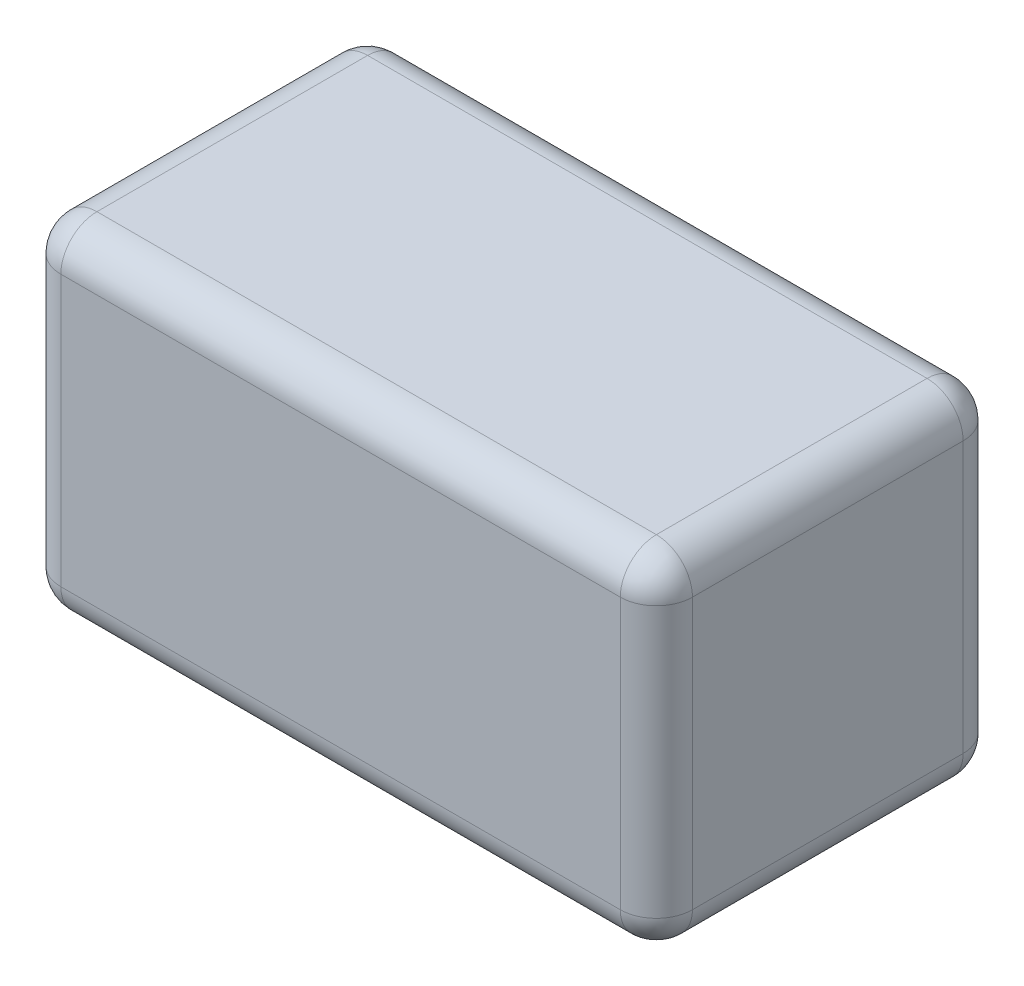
ISO-10303-21;
HEADER;
FILE_DESCRIPTION(('STEP AP214'),'2;1');
FILE_NAME('part.step','',(''),(''),'','','');
FILE_SCHEMA(('AUTOMOTIVE_DESIGN { 1 0 10303 214 1 1 1 1 }'));
ENDSEC;
DATA;
#1=APPLICATION_CONTEXT('core data for automotive mechanical design processes');
#2=APPLICATION_PROTOCOL_DEFINITION('international standard','automotive_design',2000,#1);
#3=PRODUCT_CONTEXT('',#1,'mechanical');
#4=PRODUCT('Part','Part','',(#3));
#5=PRODUCT_RELATED_PRODUCT_CATEGORY('part','',(#4));
#6=PRODUCT_DEFINITION_FORMATION('','',#4);
#7=PRODUCT_DEFINITION_CONTEXT('part definition',#1,'design');
#8=PRODUCT_DEFINITION('design','',#6,#7);
#9=PRODUCT_DEFINITION_SHAPE('','',#8);
#10=(LENGTH_UNIT() NAMED_UNIT(*) SI_UNIT(.MILLI.,.METRE.));
#11=(NAMED_UNIT(*) PLANE_ANGLE_UNIT() SI_UNIT($,.RADIAN.));
#12=(NAMED_UNIT(*) SI_UNIT($,.STERADIAN.) SOLID_ANGLE_UNIT());
#13=UNCERTAINTY_MEASURE_WITH_UNIT(LENGTH_MEASURE(1.E-05),#10,'distance_accuracy_value','');
#14=(GEOMETRIC_REPRESENTATION_CONTEXT(3) GLOBAL_UNCERTAINTY_ASSIGNED_CONTEXT((#13)) GLOBAL_UNIT_ASSIGNED_CONTEXT((#10,
#11,#12)) REPRESENTATION_CONTEXT('',''));
#15=CARTESIAN_POINT('',(0.,0.,0.));
#16=DIRECTION('',(0.,0.,1.));
#17=DIRECTION('',(1.,0.,0.));
#18=AXIS2_PLACEMENT_3D('',#15,#16,#17);
#19=CARTESIAN_POINT('',(0.775,0.375,0.85));
#20=DIRECTION('',(1.,0.,0.));
#21=DIRECTION('',(0.,1.,0.));
#22=AXIS2_PLACEMENT_3D('',#19,#20,#21);
#23=SPHERICAL_SURFACE('',#22,0.1);
#24=CARTESIAN_POINT('',(0.775,0.375,0.85));
#25=DIRECTION('',(1.,0.,0.));
#26=DIRECTION('',(0.,0.,-1.));
#27=AXIS2_PLACEMENT_3D('',#24,#25,#26);
#28=CIRCLE('',#27,0.1);
#29=CARTESIAN_POINT('',(0.775,0.375,0.95));
#30=VERTEX_POINT('',#29);
#31=CARTESIAN_POINT('',(0.775,0.475,0.85));
#32=VERTEX_POINT('',#31);
#33=EDGE_CURVE('E309',#30,#32,#28,.F.);
#34=ORIENTED_EDGE('',*,*,#33,.F.);
#35=CARTESIAN_POINT('',(0.775,0.375,0.85));
#36=DIRECTION('',(0.,-1.,0.));
#37=DIRECTION('',(0.,0.,-1.));
#38=AXIS2_PLACEMENT_3D('',#35,#36,#37);
#39=CIRCLE('',#38,0.1);
#40=CARTESIAN_POINT('',(0.875,0.375,0.85));
#41=VERTEX_POINT('',#40);
#42=EDGE_CURVE('E306',#41,#30,#39,.T.);
#43=ORIENTED_EDGE('',*,*,#42,.F.);
#44=CARTESIAN_POINT('',(0.775,0.375,0.85));
#45=DIRECTION('',(0.,0.,-1.));
#46=DIRECTION('',(-1.,0.,0.));
#47=AXIS2_PLACEMENT_3D('',#44,#45,#46);
#48=CIRCLE('',#47,0.1);
#49=EDGE_CURVE('E298',#32,#41,#48,.T.);
#50=ORIENTED_EDGE('',*,*,#49,.F.);
#51=EDGE_LOOP('',(#34,#43,#50));
#52=FACE_BOUND('',#51,.T.);
#53=ADVANCED_FACE('F16',(#52),#23,.T.);
#54=CARTESIAN_POINT('',(0.775,0.375,0.1));
#55=DIRECTION('',(0.,1.,0.));
#56=DIRECTION('',(1.,0.,0.));
#57=AXIS2_PLACEMENT_3D('',#54,#55,#56);
#58=SPHERICAL_SURFACE('',#57,0.1);
#59=CARTESIAN_POINT('',(0.775,0.375,0.1));
#60=DIRECTION('',(-1.,0.,0.));
#61=DIRECTION('',(0.,0.,1.));
#62=AXIS2_PLACEMENT_3D('',#59,#60,#61);
#63=CIRCLE('',#62,0.1);
#64=CARTESIAN_POINT('',(0.775,0.474999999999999,0.0999999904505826));
#65=VERTEX_POINT('',#64);
#66=CARTESIAN_POINT('',(0.775,0.375000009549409,0.));
#67=VERTEX_POINT('',#66);
#68=EDGE_CURVE('E288',#65,#67,#63,.T.);
#69=ORIENTED_EDGE('',*,*,#68,.F.);
#70=CARTESIAN_POINT('',(0.775,0.375,0.1));
#71=DIRECTION('',(0.,0.,-1.));
#72=DIRECTION('',(-1.,0.,0.));
#73=AXIS2_PLACEMENT_3D('',#70,#71,#72);
#74=CIRCLE('',#73,0.1);
#75=CARTESIAN_POINT('',(0.875,0.375,0.1));
#76=VERTEX_POINT('',#75);
#77=EDGE_CURVE('E295',#76,#65,#74,.F.);
#78=ORIENTED_EDGE('',*,*,#77,.F.);
#79=CARTESIAN_POINT('',(0.775,0.375,0.0999999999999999));
#80=DIRECTION('',(0.,-1.,0.));
#81=DIRECTION('',(0.,0.,-1.));
#82=AXIS2_PLACEMENT_3D('',#79,#80,#81);
#83=CIRCLE('',#82,0.1);
#84=EDGE_CURVE('E284',#67,#76,#83,.T.);
#85=ORIENTED_EDGE('',*,*,#84,.F.);
#86=EDGE_LOOP('',(#69,#78,#85));
#87=FACE_BOUND('',#86,.T.);
#88=ADVANCED_FACE('F333',(#87),#58,.T.);
#89=CARTESIAN_POINT('',(-0.775,0.375,0.0999999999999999));
#90=DIRECTION('',(-1.,0.,0.));
#91=DIRECTION('',(0.,1.,0.));
#92=AXIS2_PLACEMENT_3D('',#89,#90,#91);
#93=SPHERICAL_SURFACE('',#92,0.1);
#94=CARTESIAN_POINT('',(-0.775,0.375,0.0999999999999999));
#95=DIRECTION('',(0.,-1.,0.));
#96=DIRECTION('',(0.,0.,-1.));
#97=AXIS2_PLACEMENT_3D('',#94,#95,#96);
#98=CIRCLE('',#97,0.1);
#99=CARTESIAN_POINT('',(-0.875,0.375,0.0999999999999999));
#100=VERTEX_POINT('',#99);
#101=CARTESIAN_POINT('',(-0.775,0.375,0.));
#102=VERTEX_POINT('',#101);
#103=EDGE_CURVE('E260',#100,#102,#98,.T.);
#104=ORIENTED_EDGE('',*,*,#103,.F.);
#105=CARTESIAN_POINT('',(-0.775,0.375,0.0999999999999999));
#106=DIRECTION('',(0.,0.,1.));
#107=DIRECTION('',(1.,0.,0.));
#108=AXIS2_PLACEMENT_3D('',#105,#106,#107);
#109=CIRCLE('',#108,0.1);
#110=CARTESIAN_POINT('',(-0.775,0.475,0.0999999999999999));
#111=VERTEX_POINT('',#110);
#112=EDGE_CURVE('E265',#111,#100,#109,.T.);
#113=ORIENTED_EDGE('',*,*,#112,.F.);
#114=CARTESIAN_POINT('',(-0.775,0.375,0.0999999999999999));
#115=DIRECTION('',(-1.,0.,0.));
#116=DIRECTION('',(0.,0.,1.));
#117=AXIS2_PLACEMENT_3D('',#114,#115,#116);
#118=CIRCLE('',#117,0.1);
#119=EDGE_CURVE('E279',#102,#111,#118,.F.);
#120=ORIENTED_EDGE('',*,*,#119,.F.);
#121=EDGE_LOOP('',(#104,#113,#120));
#122=FACE_BOUND('',#121,.T.);
#123=ADVANCED_FACE('F329',(#122),#93,.T.);
#124=CARTESIAN_POINT('',(-0.775,0.375,0.85));
#125=DIRECTION('',(0.,1.,0.));
#126=DIRECTION('',(-1.,0.,0.));
#127=AXIS2_PLACEMENT_3D('',#124,#125,#126);
#128=SPHERICAL_SURFACE('',#127,0.1);
#129=CARTESIAN_POINT('',(-0.775,0.375,0.85));
#130=DIRECTION('',(0.,-1.,0.));
#131=DIRECTION('',(0.,0.,-1.));
#132=AXIS2_PLACEMENT_3D('',#129,#130,#131);
#133=CIRCLE('',#132,0.1);
#134=CARTESIAN_POINT('',(-0.775,0.375000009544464,0.95));
#135=VERTEX_POINT('',#134);
#136=CARTESIAN_POINT('',(-0.875,0.375,0.85));
#137=VERTEX_POINT('',#136);
#138=EDGE_CURVE('E253',#135,#137,#133,.T.);
#139=ORIENTED_EDGE('',*,*,#138,.F.);
#140=CARTESIAN_POINT('',(-0.775,0.375,0.85));
#141=DIRECTION('',(1.,0.,0.));
#142=DIRECTION('',(0.,0.,-1.));
#143=AXIS2_PLACEMENT_3D('',#140,#141,#142);
#144=CIRCLE('',#143,0.1);
#145=CARTESIAN_POINT('',(-0.775,0.474999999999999,0.850000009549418));
#146=VERTEX_POINT('',#145);
#147=EDGE_CURVE('E255',#146,#135,#144,.T.);
#148=ORIENTED_EDGE('',*,*,#147,.F.);
#149=CARTESIAN_POINT('',(-0.775,0.375,0.85));
#150=DIRECTION('',(0.,0.,1.));
#151=DIRECTION('',(1.,0.,0.));
#152=AXIS2_PLACEMENT_3D('',#149,#150,#151);
#153=CIRCLE('',#152,0.1);
#154=EDGE_CURVE('E276',#137,#146,#153,.F.);
#155=ORIENTED_EDGE('',*,*,#154,.F.);
#156=EDGE_LOOP('',(#139,#148,#155));
#157=FACE_BOUND('',#156,.T.);
#158=ADVANCED_FACE('F324',(#157),#128,.T.);
#159=CARTESIAN_POINT('',(0.775,-0.775,0.85));
#160=DIRECTION('',(0.,-1.,0.));
#161=DIRECTION('',(0.,0.,-1.));
#162=AXIS2_PLACEMENT_3D('',#159,#160,#161);
#163=CYLINDRICAL_SURFACE('',#162,0.1);
#164=DIRECTION('',(0.,1.,0.));
#165=VECTOR('',#164,1.);
#166=CARTESIAN_POINT('',(0.875,-0.475,0.85));
#167=LINE('',#166,#165);
#168=CARTESIAN_POINT('',(0.875,-0.375,0.85));
#169=VERTEX_POINT('',#168);
#170=EDGE_CURVE('E241',#41,#169,#167,.F.);
#171=ORIENTED_EDGE('',*,*,#170,.F.);
#172=ORIENTED_EDGE('',*,*,#42,.T.);
#173=DIRECTION('',(0.,1.,0.));
#174=VECTOR('',#173,1.);
#175=CARTESIAN_POINT('',(0.775,-0.475,0.95));
#176=LINE('',#175,#174);
#177=CARTESIAN_POINT('',(0.775,-0.375000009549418,0.95));
#178=VERTEX_POINT('',#177);
#179=EDGE_CURVE('E242',#178,#30,#176,.T.);
#180=ORIENTED_EDGE('',*,*,#179,.F.);
#181=CARTESIAN_POINT('',(0.775,-0.375,0.85));
#182=DIRECTION('',(0.,-1.,0.));
#183=DIRECTION('',(1.,0.,0.));
#184=AXIS2_PLACEMENT_3D('',#181,#182,#183);
#185=CIRCLE('',#184,0.1);
#186=EDGE_CURVE('E238',#169,#178,#185,.T.);
#187=ORIENTED_EDGE('',*,*,#186,.F.);
#188=EDGE_LOOP('',(#171,#172,#180,#187));
#189=FACE_BOUND('',#188,.T.);
#190=ADVANCED_FACE('F328',(#189),#163,.T.);
#191=CARTESIAN_POINT('',(0.775,0.375,1.35));
#192=DIRECTION('',(0.,0.,-1.));
#193=DIRECTION('',(-1.,0.,0.));
#194=AXIS2_PLACEMENT_3D('',#191,#192,#193);
#195=CYLINDRICAL_SURFACE('',#194,0.1);
#196=ORIENTED_EDGE('',*,*,#77,.T.);
#197=DIRECTION('',(0.,0.,-1.));
#198=VECTOR('',#197,1.);
#199=CARTESIAN_POINT('',(0.775,0.475,1.35));
#200=LINE('',#199,#198);
#201=EDGE_CURVE('E292',#65,#32,#200,.F.);
#202=ORIENTED_EDGE('',*,*,#201,.T.);
#203=ORIENTED_EDGE('',*,*,#49,.T.);
#204=DIRECTION('',(0.,0.,-1.));
#205=VECTOR('',#204,1.);
#206=CARTESIAN_POINT('',(0.875,0.375,0.95));
#207=LINE('',#206,#205);
#208=EDGE_CURVE('E301',#76,#41,#207,.F.);
#209=ORIENTED_EDGE('',*,*,#208,.F.);
#210=EDGE_LOOP('',(#196,#202,#203,#209));
#211=FACE_BOUND('',#210,.T.);
#212=ADVANCED_FACE('F433',(#211),#195,.T.);
#213=CARTESIAN_POINT('',(0.,0.475,0.));
#214=DIRECTION('',(0.,1.,0.));
#215=DIRECTION('',(0.,0.,1.));
#216=AXIS2_PLACEMENT_3D('',#213,#214,#215);
#217=PLANE('',#216);
#218=DIRECTION('',(0.,0.,1.));
#219=VECTOR('',#218,1.);
#220=CARTESIAN_POINT('',(-0.775,0.475,-0.4));
#221=LINE('',#220,#219);
#222=EDGE_CURVE('E273',#146,#111,#221,.F.);
#223=ORIENTED_EDGE('',*,*,#222,.F.);
#224=DIRECTION('',(1.,0.,0.));
#225=VECTOR('',#224,1.);
#226=CARTESIAN_POINT('',(-1.175,0.474999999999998,0.850000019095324));
#227=LINE('',#226,#225);
#228=EDGE_CURVE('E250',#32,#146,#227,.F.);
#229=ORIENTED_EDGE('',*,*,#228,.F.);
#230=ORIENTED_EDGE('',*,*,#201,.F.);
#231=DIRECTION('',(-1.,0.,0.));
#232=VECTOR('',#231,1.);
#233=CARTESIAN_POINT('',(1.175,0.475,0.100000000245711));
#234=LINE('',#233,#232);
#235=EDGE_CURVE('E124',#111,#65,#234,.F.);
#236=ORIENTED_EDGE('',*,*,#235,.F.);
#237=EDGE_LOOP('',(#223,#229,#230,#236));
#238=FACE_BOUND('',#237,.T.);
#239=ADVANCED_FACE('F375',(#238),#217,.T.);
#240=CARTESIAN_POINT('',(0.775,-0.775,0.1));
#241=DIRECTION('',(0.,-1.,0.));
#242=DIRECTION('',(0.,0.,-1.));
#243=AXIS2_PLACEMENT_3D('',#240,#241,#242);
#244=CYLINDRICAL_SURFACE('',#243,0.1);
#245=DIRECTION('',(0.,1.,0.));
#246=VECTOR('',#245,1.);
#247=CARTESIAN_POINT('',(0.775,-0.475,0.));
#248=LINE('',#247,#246);
#249=CARTESIAN_POINT('',(0.775,-0.375,0.));
#250=VERTEX_POINT('',#249);
#251=EDGE_CURVE('E117',#67,#250,#248,.F.);
#252=ORIENTED_EDGE('',*,*,#251,.F.);
#253=ORIENTED_EDGE('',*,*,#84,.T.);
#254=DIRECTION('',(0.,1.,0.));
#255=VECTOR('',#254,1.);
#256=CARTESIAN_POINT('',(0.875,-0.475,0.1));
#257=LINE('',#256,#255);
#258=CARTESIAN_POINT('',(0.875,-0.375,0.1));
#259=VERTEX_POINT('',#258);
#260=EDGE_CURVE('E129',#259,#76,#257,.T.);
#261=ORIENTED_EDGE('',*,*,#260,.F.);
#262=CARTESIAN_POINT('',(0.775,-0.375,0.1));
#263=DIRECTION('',(0.,1.,0.));
#264=DIRECTION('',(1.,0.,0.));
#265=AXIS2_PLACEMENT_3D('',#262,#263,#264);
#266=CIRCLE('',#265,0.1);
#267=EDGE_CURVE('E123',#250,#259,#266,.F.);
#268=ORIENTED_EDGE('',*,*,#267,.F.);
#269=EDGE_LOOP('',(#252,#253,#261,#268));
#270=FACE_BOUND('',#269,.T.);
#271=ADVANCED_FACE('F127',(#270),#244,.T.);
#272=CARTESIAN_POINT('',(-0.775,0.375,-0.4));
#273=DIRECTION('',(0.,0.,1.));
#274=DIRECTION('',(1.,0.,0.));
#275=AXIS2_PLACEMENT_3D('',#272,#273,#274);
#276=CYLINDRICAL_SURFACE('',#275,0.1);
#277=ORIENTED_EDGE('',*,*,#112,.T.);
#278=DIRECTION('',(0.,0.,1.));
#279=VECTOR('',#278,1.);
#280=CARTESIAN_POINT('',(-0.875,0.375,0.));
#281=LINE('',#280,#279);
#282=EDGE_CURVE('E203',#137,#100,#281,.F.);
#283=ORIENTED_EDGE('',*,*,#282,.F.);
#284=ORIENTED_EDGE('',*,*,#154,.T.);
#285=ORIENTED_EDGE('',*,*,#222,.T.);
#286=EDGE_LOOP('',(#277,#283,#284,#285));
#287=FACE_BOUND('',#286,.T.);
#288=ADVANCED_FACE('F373',(#287),#276,.T.);
#289=CARTESIAN_POINT('',(-0.775,-0.775,0.0999999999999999));
#290=DIRECTION('',(0.,-1.,0.));
#291=DIRECTION('',(0.,0.,-1.));
#292=AXIS2_PLACEMENT_3D('',#289,#290,#291);
#293=CYLINDRICAL_SURFACE('',#292,0.1);
#294=DIRECTION('',(0.,1.,0.));
#295=VECTOR('',#294,1.);
#296=CARTESIAN_POINT('',(-0.875,-0.475,0.0999999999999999));
#297=LINE('',#296,#295);
#298=CARTESIAN_POINT('',(-0.875,-0.375,0.0999999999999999));
#299=VERTEX_POINT('',#298);
#300=EDGE_CURVE('E193',#100,#299,#297,.F.);
#301=ORIENTED_EDGE('',*,*,#300,.F.);
#302=ORIENTED_EDGE('',*,*,#103,.T.);
#303=DIRECTION('',(0.,1.,0.));
#304=VECTOR('',#303,1.);
#305=CARTESIAN_POINT('',(-0.775,-0.475,0.));
#306=LINE('',#305,#304);
#307=CARTESIAN_POINT('',(-0.775,-0.375000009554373,0.));
#308=VERTEX_POINT('',#307);
#309=EDGE_CURVE('E133',#308,#102,#306,.T.);
#310=ORIENTED_EDGE('',*,*,#309,.F.);
#311=CARTESIAN_POINT('',(-0.775,-0.375,0.0999999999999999));
#312=DIRECTION('',(0.,-1.,0.));
#313=DIRECTION('',(-1.,0.,0.));
#314=AXIS2_PLACEMENT_3D('',#311,#312,#313);
#315=CIRCLE('',#314,0.1);
#316=EDGE_CURVE('E190',#299,#308,#315,.T.);
#317=ORIENTED_EDGE('',*,*,#316,.F.);
#318=EDGE_LOOP('',(#301,#302,#310,#317));
#319=FACE_BOUND('',#318,.T.);
#320=ADVANCED_FACE('F501',(#319),#293,.T.);
#321=CARTESIAN_POINT('',(-0.775,-0.775,0.85));
#322=DIRECTION('',(0.,-1.,0.));
#323=DIRECTION('',(0.,0.,-1.));
#324=AXIS2_PLACEMENT_3D('',#321,#322,#323);
#325=CYLINDRICAL_SURFACE('',#324,0.1);
#326=DIRECTION('',(0.,1.,0.));
#327=VECTOR('',#326,1.);
#328=CARTESIAN_POINT('',(-0.775,-0.475,0.95));
#329=LINE('',#328,#327);
#330=CARTESIAN_POINT('',(-0.775,-0.375,0.95));
#331=VERTEX_POINT('',#330);
#332=EDGE_CURVE('E192',#135,#331,#329,.F.);
#333=ORIENTED_EDGE('',*,*,#332,.F.);
#334=ORIENTED_EDGE('',*,*,#138,.T.);
#335=DIRECTION('',(0.,1.,0.));
#336=VECTOR('',#335,1.);
#337=CARTESIAN_POINT('',(-0.875,-0.475,0.85));
#338=LINE('',#337,#336);
#339=CARTESIAN_POINT('',(-0.875,-0.375,0.85));
#340=VERTEX_POINT('',#339);
#341=EDGE_CURVE('E206',#340,#137,#338,.T.);
#342=ORIENTED_EDGE('',*,*,#341,.F.);
#343=CARTESIAN_POINT('',(-0.775,-0.375,0.85));
#344=DIRECTION('',(0.,1.,0.));
#345=DIRECTION('',(-1.,0.,0.));
#346=AXIS2_PLACEMENT_3D('',#343,#344,#345);
#347=CIRCLE('',#346,0.1);
#348=EDGE_CURVE('E168',#331,#340,#347,.F.);
#349=ORIENTED_EDGE('',*,*,#348,.F.);
#350=EDGE_LOOP('',(#333,#334,#342,#349));
#351=FACE_BOUND('',#350,.T.);
#352=ADVANCED_FACE('F385',(#351),#325,.T.);
#353=CARTESIAN_POINT('',(-1.175,0.375,0.85));
#354=DIRECTION('',(1.,0.,0.));
#355=DIRECTION('',(0.,0.,-1.));
#356=AXIS2_PLACEMENT_3D('',#353,#354,#355);
#357=CYLINDRICAL_SURFACE('',#356,0.1);
#358=DIRECTION('',(1.,0.,0.));
#359=VECTOR('',#358,1.);
#360=CARTESIAN_POINT('',(-0.875,0.375000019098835,0.95));
#361=LINE('',#360,#359);
#362=EDGE_CURVE('E163',#30,#135,#361,.F.);
#363=ORIENTED_EDGE('',*,*,#362,.F.);
#364=ORIENTED_EDGE('',*,*,#33,.T.);
#365=ORIENTED_EDGE('',*,*,#228,.T.);
#366=ORIENTED_EDGE('',*,*,#147,.T.);
#367=EDGE_LOOP('',(#363,#364,#365,#366));
#368=FACE_BOUND('',#367,.T.);
#369=ADVANCED_FACE('F230',(#368),#357,.T.);
#370=CARTESIAN_POINT('',(0.775,-0.375,0.85));
#371=DIRECTION('',(0.,-1.,0.));
#372=DIRECTION('',(1.,0.,0.));
#373=AXIS2_PLACEMENT_3D('',#370,#371,#372);
#374=SPHERICAL_SURFACE('',#373,0.1);
#375=CARTESIAN_POINT('',(0.775,-0.375,0.85));
#376=DIRECTION('',(-1.,0.,0.));
#377=DIRECTION('',(0.,0.,1.));
#378=AXIS2_PLACEMENT_3D('',#375,#376,#377);
#379=CIRCLE('',#378,0.1);
#380=CARTESIAN_POINT('',(0.775,-0.475,0.850000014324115));
#381=VERTEX_POINT('',#380);
#382=EDGE_CURVE('E158',#381,#178,#379,.T.);
#383=ORIENTED_EDGE('',*,*,#382,.F.);
#384=CARTESIAN_POINT('',(0.775,-0.375,0.85));
#385=DIRECTION('',(0.,0.,1.));
#386=DIRECTION('',(1.,0.,0.));
#387=AXIS2_PLACEMENT_3D('',#384,#385,#386);
#388=CIRCLE('',#387,0.1);
#389=EDGE_CURVE('E153',#169,#381,#388,.F.);
#390=ORIENTED_EDGE('',*,*,#389,.F.);
#391=ORIENTED_EDGE('',*,*,#186,.T.);
#392=EDGE_LOOP('',(#383,#390,#391));
#393=FACE_BOUND('',#392,.T.);
#394=ADVANCED_FACE('F225',(#393),#374,.T.);
#395=CARTESIAN_POINT('',(0.875,-0.475,0.95));
#396=DIRECTION('',(1.,0.,0.));
#397=DIRECTION('',(0.,0.,-1.));
#398=AXIS2_PLACEMENT_3D('',#395,#396,#397);
#399=PLANE('',#398);
#400=ORIENTED_EDGE('',*,*,#260,.T.);
#401=ORIENTED_EDGE('',*,*,#208,.T.);
#402=ORIENTED_EDGE('',*,*,#170,.T.);
#403=DIRECTION('',(0.,0.,1.));
#404=VECTOR('',#403,1.);
#405=CARTESIAN_POINT('',(0.875,-0.375,1.35));
#406=LINE('',#405,#404);
#407=EDGE_CURVE('E141',#259,#169,#406,.T.);
#408=ORIENTED_EDGE('',*,*,#407,.F.);
#409=EDGE_LOOP('',(#400,#401,#402,#408));
#410=FACE_BOUND('',#409,.T.);
#411=ADVANCED_FACE('F221',(#410),#399,.T.);
#412=CARTESIAN_POINT('',(1.175,0.375,0.1));
#413=DIRECTION('',(-1.,0.,0.));
#414=DIRECTION('',(0.,0.,1.));
#415=AXIS2_PLACEMENT_3D('',#412,#413,#414);
#416=CYLINDRICAL_SURFACE('',#415,0.1);
#417=DIRECTION('',(-1.,0.,0.));
#418=VECTOR('',#417,1.);
#419=CARTESIAN_POINT('',(0.875,0.374999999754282,0.));
#420=LINE('',#419,#418);
#421=EDGE_CURVE('E120',#102,#67,#420,.F.);
#422=ORIENTED_EDGE('',*,*,#421,.F.);
#423=ORIENTED_EDGE('',*,*,#119,.T.);
#424=ORIENTED_EDGE('',*,*,#235,.T.);
#425=ORIENTED_EDGE('',*,*,#68,.T.);
#426=EDGE_LOOP('',(#422,#423,#424,#425));
#427=FACE_BOUND('',#426,.T.);
#428=ADVANCED_FACE('F218',(#427),#416,.T.);
#429=CARTESIAN_POINT('',(0.775,-0.375,0.1));
#430=DIRECTION('',(1.,0.,0.));
#431=DIRECTION('',(0.,-1.,0.));
#432=AXIS2_PLACEMENT_3D('',#429,#430,#431);
#433=SPHERICAL_SURFACE('',#432,0.1);
#434=CARTESIAN_POINT('',(0.775,-0.375,0.1));
#435=DIRECTION('',(1.,0.,0.));
#436=DIRECTION('',(0.,0.,-1.));
#437=AXIS2_PLACEMENT_3D('',#434,#435,#436);
#438=CIRCLE('',#437,0.1);
#439=CARTESIAN_POINT('',(0.775,-0.475,0.1));
#440=VERTEX_POINT('',#439);
#441=EDGE_CURVE('E105',#250,#440,#438,.F.);
#442=ORIENTED_EDGE('',*,*,#441,.F.);
#443=ORIENTED_EDGE('',*,*,#267,.T.);
#444=CARTESIAN_POINT('',(0.775,-0.375,0.1));
#445=DIRECTION('',(0.,0.,1.));
#446=DIRECTION('',(1.,0.,0.));
#447=AXIS2_PLACEMENT_3D('',#444,#445,#446);
#448=CIRCLE('',#447,0.1);
#449=EDGE_CURVE('E136',#440,#259,#448,.T.);
#450=ORIENTED_EDGE('',*,*,#449,.F.);
#451=EDGE_LOOP('',(#442,#443,#450));
#452=FACE_BOUND('',#451,.T.);
#453=ADVANCED_FACE('F135',(#452),#433,.T.);
#454=CARTESIAN_POINT('',(-0.875,-0.475,0.));
#455=DIRECTION('',(-1.,0.,0.));
#456=DIRECTION('',(0.,0.,1.));
#457=AXIS2_PLACEMENT_3D('',#454,#455,#456);
#458=PLANE('',#457);
#459=ORIENTED_EDGE('',*,*,#300,.T.);
#460=DIRECTION('',(0.,0.,-1.));
#461=VECTOR('',#460,1.);
#462=CARTESIAN_POINT('',(-0.875,-0.375,-0.4));
#463=LINE('',#462,#461);
#464=EDGE_CURVE('E196',#340,#299,#463,.T.);
#465=ORIENTED_EDGE('',*,*,#464,.F.);
#466=ORIENTED_EDGE('',*,*,#341,.T.);
#467=ORIENTED_EDGE('',*,*,#282,.T.);
#468=EDGE_LOOP('',(#459,#465,#466,#467));
#469=FACE_BOUND('',#468,.T.);
#470=ADVANCED_FACE('F182',(#469),#458,.T.);
#471=CARTESIAN_POINT('',(-0.775,-0.375,0.0999999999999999));
#472=DIRECTION('',(0.,-1.,0.));
#473=DIRECTION('',(-1.,0.,0.));
#474=AXIS2_PLACEMENT_3D('',#471,#472,#473);
#475=SPHERICAL_SURFACE('',#474,0.1);
#476=CARTESIAN_POINT('',(-0.775,-0.375,0.0999999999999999));
#477=DIRECTION('',(0.,0.,-1.));
#478=DIRECTION('',(-1.,0.,0.));
#479=AXIS2_PLACEMENT_3D('',#476,#477,#478);
#480=CIRCLE('',#479,0.1);
#481=CARTESIAN_POINT('',(-0.775,-0.475,0.0999999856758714));
#482=VERTEX_POINT('',#481);
#483=EDGE_CURVE('E199',#299,#482,#480,.F.);
#484=ORIENTED_EDGE('',*,*,#483,.F.);
#485=ORIENTED_EDGE('',*,*,#316,.T.);
#486=CARTESIAN_POINT('',(-0.775,-0.375,0.0999999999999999));
#487=DIRECTION('',(1.,0.,0.));
#488=DIRECTION('',(0.,0.,-1.));
#489=AXIS2_PLACEMENT_3D('',#486,#487,#488);
#490=CIRCLE('',#489,0.1);
#491=EDGE_CURVE('E108',#482,#308,#490,.T.);
#492=ORIENTED_EDGE('',*,*,#491,.F.);
#493=EDGE_LOOP('',(#484,#485,#492));
#494=FACE_BOUND('',#493,.T.);
#495=ADVANCED_FACE('F176',(#494),#475,.T.);
#496=CARTESIAN_POINT('',(-0.775,-0.375,0.85));
#497=DIRECTION('',(-1.,0.,0.));
#498=DIRECTION('',(0.,-1.,0.));
#499=AXIS2_PLACEMENT_3D('',#496,#497,#498);
#500=SPHERICAL_SURFACE('',#499,0.1);
#501=CARTESIAN_POINT('',(-0.775,-0.375,0.85));
#502=DIRECTION('',(0.,0.,-1.));
#503=DIRECTION('',(-1.,0.,0.));
#504=AXIS2_PLACEMENT_3D('',#501,#502,#503);
#505=CIRCLE('',#504,0.1);
#506=CARTESIAN_POINT('',(-0.775,-0.475,0.85));
#507=VERTEX_POINT('',#506);
#508=EDGE_CURVE('E139',#507,#340,#505,.T.);
#509=ORIENTED_EDGE('',*,*,#508,.F.);
#510=CARTESIAN_POINT('',(-0.775,-0.375,0.85));
#511=DIRECTION('',(-1.,0.,0.));
#512=DIRECTION('',(0.,0.,1.));
#513=AXIS2_PLACEMENT_3D('',#510,#511,#512);
#514=CIRCLE('',#513,0.1);
#515=EDGE_CURVE('E347',#331,#507,#514,.F.);
#516=ORIENTED_EDGE('',*,*,#515,.F.);
#517=ORIENTED_EDGE('',*,*,#348,.T.);
#518=EDGE_LOOP('',(#509,#516,#517));
#519=FACE_BOUND('',#518,.T.);
#520=ADVANCED_FACE('F171',(#519),#500,.T.);
#521=CARTESIAN_POINT('',(-0.875,-0.475,0.95));
#522=DIRECTION('',(0.,0.,1.));
#523=DIRECTION('',(1.,0.,0.));
#524=AXIS2_PLACEMENT_3D('',#521,#522,#523);
#525=PLANE('',#524);
#526=ORIENTED_EDGE('',*,*,#362,.T.);
#527=ORIENTED_EDGE('',*,*,#332,.T.);
#528=DIRECTION('',(1.,0.,0.));
#529=VECTOR('',#528,1.);
#530=CARTESIAN_POINT('',(-0.875,-0.375000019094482,0.95));
#531=LINE('',#530,#529);
#532=EDGE_CURVE('E149',#178,#331,#531,.F.);
#533=ORIENTED_EDGE('',*,*,#532,.F.);
#534=ORIENTED_EDGE('',*,*,#179,.T.);
#535=EDGE_LOOP('',(#526,#527,#533,#534));
#536=FACE_BOUND('',#535,.T.);
#537=ADVANCED_FACE('F175',(#536),#525,.T.);
#538=CARTESIAN_POINT('',(0.775,-0.375,1.35));
#539=DIRECTION('',(0.,0.,1.));
#540=DIRECTION('',(1.,0.,0.));
#541=AXIS2_PLACEMENT_3D('',#538,#539,#540);
#542=CYLINDRICAL_SURFACE('',#541,0.1);
#543=ORIENTED_EDGE('',*,*,#449,.T.);
#544=ORIENTED_EDGE('',*,*,#407,.T.);
#545=ORIENTED_EDGE('',*,*,#389,.T.);
#546=DIRECTION('',(0.,0.,1.));
#547=VECTOR('',#546,1.);
#548=CARTESIAN_POINT('',(0.775,-0.475,0.));
#549=LINE('',#548,#547);
#550=EDGE_CURVE('E114',#381,#440,#549,.F.);
#551=ORIENTED_EDGE('',*,*,#550,.T.);
#552=EDGE_LOOP('',(#543,#544,#545,#551));
#553=FACE_BOUND('',#552,.T.);
#554=ADVANCED_FACE('F421',(#553),#542,.T.);
#555=CARTESIAN_POINT('',(0.875,-0.475,0.));
#556=DIRECTION('',(0.,0.,-1.));
#557=DIRECTION('',(-1.,0.,0.));
#558=AXIS2_PLACEMENT_3D('',#555,#556,#557);
#559=PLANE('',#558);
#560=ORIENTED_EDGE('',*,*,#251,.T.);
#561=DIRECTION('',(-1.,0.,0.));
#562=VECTOR('',#561,1.);
#563=CARTESIAN_POINT('',(0.875,-0.375000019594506,0.));
#564=LINE('',#563,#562);
#565=EDGE_CURVE('E101',#308,#250,#564,.F.);
#566=ORIENTED_EDGE('',*,*,#565,.F.);
#567=ORIENTED_EDGE('',*,*,#309,.T.);
#568=ORIENTED_EDGE('',*,*,#421,.T.);
#569=EDGE_LOOP('',(#560,#566,#567,#568));
#570=FACE_BOUND('',#569,.T.);
#571=ADVANCED_FACE('F119',(#570),#559,.T.);
#572=CARTESIAN_POINT('',(-0.775,-0.375,-0.4));
#573=DIRECTION('',(0.,0.,-1.));
#574=DIRECTION('',(-1.,0.,0.));
#575=AXIS2_PLACEMENT_3D('',#572,#573,#574);
#576=CYLINDRICAL_SURFACE('',#575,0.1);
#577=ORIENTED_EDGE('',*,*,#483,.T.);
#578=DIRECTION('',(0.,0.,1.));
#579=VECTOR('',#578,1.);
#580=CARTESIAN_POINT('',(-0.775,-0.475,0.));
#581=LINE('',#580,#579);
#582=EDGE_CURVE('E113',#482,#507,#581,.T.);
#583=ORIENTED_EDGE('',*,*,#582,.T.);
#584=ORIENTED_EDGE('',*,*,#508,.T.);
#585=ORIENTED_EDGE('',*,*,#464,.T.);
#586=EDGE_LOOP('',(#577,#583,#584,#585));
#587=FACE_BOUND('',#586,.T.);
#588=ADVANCED_FACE('F396',(#587),#576,.T.);
#589=CARTESIAN_POINT('',(-1.175,-0.375,0.85));
#590=DIRECTION('',(-1.,0.,0.));
#591=DIRECTION('',(0.,0.,1.));
#592=AXIS2_PLACEMENT_3D('',#589,#590,#591);
#593=CYLINDRICAL_SURFACE('',#592,0.1);
#594=DIRECTION('',(1.,0.,0.));
#595=VECTOR('',#594,1.);
#596=CARTESIAN_POINT('',(0.,-0.475,0.850000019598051));
#597=LINE('',#596,#595);
#598=EDGE_CURVE('E26',#507,#381,#597,.T.);
#599=ORIENTED_EDGE('',*,*,#598,.T.);
#600=ORIENTED_EDGE('',*,*,#382,.T.);
#601=ORIENTED_EDGE('',*,*,#532,.T.);
#602=ORIENTED_EDGE('',*,*,#515,.T.);
#603=EDGE_LOOP('',(#599,#600,#601,#602));
#604=FACE_BOUND('',#603,.T.);
#605=ADVANCED_FACE('F412',(#604),#593,.T.);
#606=CARTESIAN_POINT('',(1.175,-0.375,0.1));
#607=DIRECTION('',(1.,0.,0.));
#608=DIRECTION('',(0.,0.,-1.));
#609=AXIS2_PLACEMENT_3D('',#606,#607,#608);
#610=CYLINDRICAL_SURFACE('',#609,0.1);
#611=ORIENTED_EDGE('',*,*,#565,.T.);
#612=ORIENTED_EDGE('',*,*,#441,.T.);
#613=DIRECTION('',(1.,0.,0.));
#614=VECTOR('',#613,1.);
#615=CARTESIAN_POINT('',(0.,-0.475,0.0999999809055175));
#616=LINE('',#615,#614);
#617=EDGE_CURVE('E11',#440,#482,#616,.F.);
#618=ORIENTED_EDGE('',*,*,#617,.T.);
#619=ORIENTED_EDGE('',*,*,#491,.T.);
#620=EDGE_LOOP('',(#611,#612,#618,#619));
#621=FACE_BOUND('',#620,.T.);
#622=ADVANCED_FACE('F103',(#621),#610,.T.);
#623=CARTESIAN_POINT('',(0.,-0.475,0.));
#624=DIRECTION('',(0.,1.,0.));
#625=DIRECTION('',(0.,0.,1.));
#626=AXIS2_PLACEMENT_3D('',#623,#624,#625);
#627=PLANE('',#626);
#628=ORIENTED_EDGE('',*,*,#582,.F.);
#629=ORIENTED_EDGE('',*,*,#617,.F.);
#630=ORIENTED_EDGE('',*,*,#550,.F.);
#631=ORIENTED_EDGE('',*,*,#598,.F.);
#632=EDGE_LOOP('',(#628,#629,#630,#631));
#633=FACE_BOUND('',#632,.T.);
#634=ADVANCED_FACE('F440',(#633),#627,.F.);
#635=CLOSED_SHELL('',(#53,#88,#123,#158,#190,#212,#239,#271,#288,#320,#352,#369,#394,#411,#428,
#453,#470,#495,#520,#537,#554,#571,#588,#605,#622,#634));
#636=MANIFOLD_SOLID_BREP('B1',#635);
#637=ADVANCED_BREP_SHAPE_REPRESENTATION('',(#18,#636),#14);
#638=SHAPE_DEFINITION_REPRESENTATION(#9,#637);
ENDSEC;
END-ISO-10303-21;
